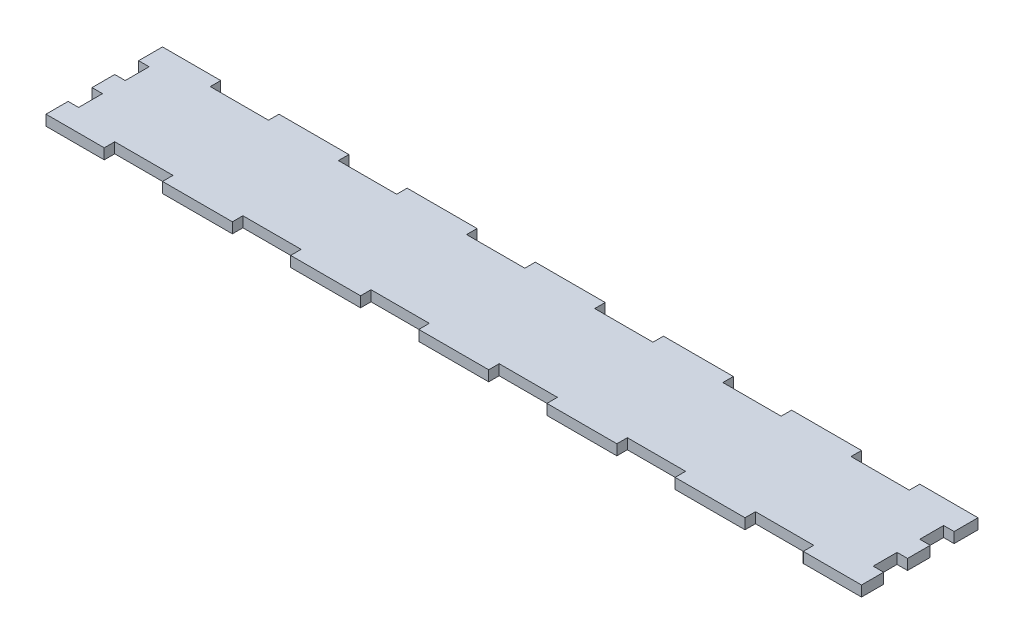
from build123d import *

# Parameters (mm, degrees)
BOSS_EXTRUDE1_DEPTH = 9
SKETCH2_W           = 50
SKETCH2_H           = 9
CUT_EXTRUDE1_DEPTH  = 9


with BuildPart() as part:
    # Sketch1 → Boss-Extrude1 (new body)
    with BuildSketch(Plane(origin=(0, 0, 0), x_dir=(1, 0, 0), z_dir=(0, 1, 0))):
        Polygon((-350, 50), (350, 50), (350, 29.5), (341, 29.5), (341, 9), (350, 9), (350, -10.5), (341, -10.5), (341, -31), (350, -31), (350, -50), (-350, -50), (-350, -31), (-341, -31), (-341, -10.5), (-350, -10.5), (-350, 9), (-341, 9), (-341, 29.5), (-350, 29.5), align=None)
    extrude(amount=BOSS_EXTRUDE1_DEPTH)

    # Sketch2 → Cut-Extrude1 (cut)
    with BuildSketch(Plane(origin=(0, 9, 0), x_dir=(1, 0, 0), z_dir=(0, 1, 0))):
        with Locations((-275, 45.5)):
            Rectangle(SKETCH2_W, SKETCH2_H)
        with Locations((-165, 45.5)):
            Rectangle(SKETCH2_W, SKETCH2_H)
        with Locations((-55, 45.5)):
            Rectangle(SKETCH2_W, SKETCH2_H)
        with Locations((55, 45.5)):
            Rectangle(SKETCH2_W, SKETCH2_H)
        with Locations((165, 45.5)):
            Rectangle(SKETCH2_W, SKETCH2_H)
        with Locations((275, 45.5)):
            Rectangle(SKETCH2_W, SKETCH2_H)
        with Locations((275, -45.5)):
            Rectangle(SKETCH2_W, SKETCH2_H)
        with Locations((165, -45.5)):
            Rectangle(SKETCH2_W, SKETCH2_H)
        with Locations((55, -45.5)):
            Rectangle(SKETCH2_W, SKETCH2_H)
        with Locations((-55, -45.5)):
            Rectangle(SKETCH2_W, SKETCH2_H)
        with Locations((-165, -45.5)):
            Rectangle(SKETCH2_W, SKETCH2_H)
        with Locations((-275, -45.5)):
            Rectangle(SKETCH2_W, SKETCH2_H)
    extrude(amount=-CUT_EXTRUDE1_DEPTH, mode=Mode.SUBTRACT)


solid = part.part
